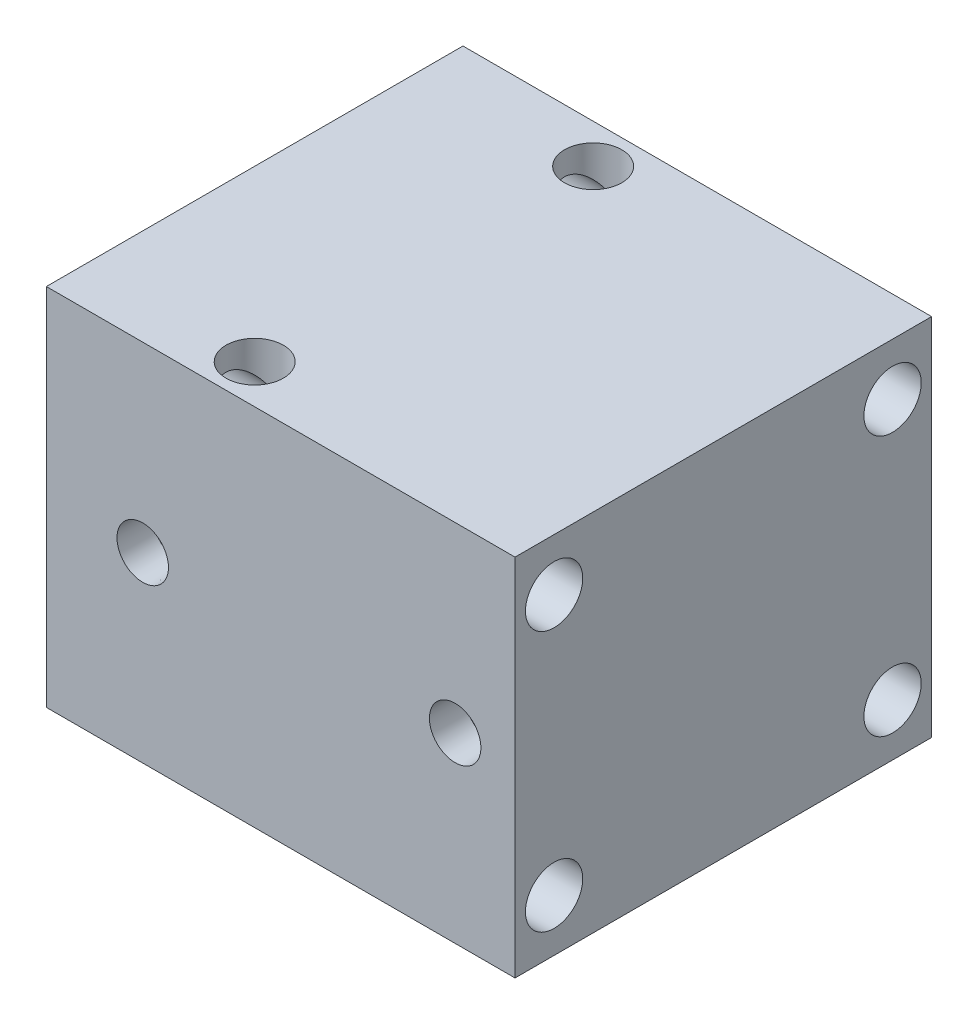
ISO-10303-21;
HEADER;
FILE_DESCRIPTION(('STEP AP214'),'2;1');
FILE_NAME('part.step','',(''),(''),'','','');
FILE_SCHEMA(('AUTOMOTIVE_DESIGN { 1 0 10303 214 1 1 1 1 }'));
ENDSEC;
DATA;
#1=APPLICATION_CONTEXT('core data for automotive mechanical design processes');
#2=APPLICATION_PROTOCOL_DEFINITION('international standard','automotive_design',2000,#1);
#3=PRODUCT_CONTEXT('',#1,'mechanical');
#4=PRODUCT('Part','Part','',(#3));
#5=PRODUCT_RELATED_PRODUCT_CATEGORY('part','',(#4));
#6=PRODUCT_DEFINITION_FORMATION('','',#4);
#7=PRODUCT_DEFINITION_CONTEXT('part definition',#1,'design');
#8=PRODUCT_DEFINITION('design','',#6,#7);
#9=PRODUCT_DEFINITION_SHAPE('','',#8);
#10=(LENGTH_UNIT() NAMED_UNIT(*) SI_UNIT(.MILLI.,.METRE.));
#11=(NAMED_UNIT(*) PLANE_ANGLE_UNIT() SI_UNIT($,.RADIAN.));
#12=(NAMED_UNIT(*) SI_UNIT($,.STERADIAN.) SOLID_ANGLE_UNIT());
#13=UNCERTAINTY_MEASURE_WITH_UNIT(LENGTH_MEASURE(1.E-05),#10,'distance_accuracy_value','');
#14=(GEOMETRIC_REPRESENTATION_CONTEXT(3) GLOBAL_UNCERTAINTY_ASSIGNED_CONTEXT((#13)) GLOBAL_UNIT_ASSIGNED_CONTEXT((#10,
#11,#12)) REPRESENTATION_CONTEXT('',''));
#15=CARTESIAN_POINT('',(0.,0.,0.));
#16=DIRECTION('',(0.,0.,1.));
#17=DIRECTION('',(1.,0.,0.));
#18=AXIS2_PLACEMENT_3D('',#15,#16,#17);
#19=CARTESIAN_POINT('',(-25.,140.,65.));
#20=DIRECTION('',(0.,-1.,0.));
#21=DIRECTION('',(0.,0.,-1.));
#22=AXIS2_PLACEMENT_3D('',#19,#20,#21);
#23=CYLINDRICAL_SURFACE('',#22,11.);
#24=CARTESIAN_POINT('',(-25.,20.,65.));
#25=DIRECTION('',(-0.707106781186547,-0.707106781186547,0.));
#26=DIRECTION('',(0.707106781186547,-0.707106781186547,0.));
#27=AXIS2_PLACEMENT_3D('',#24,#25,#26);
#28=ELLIPSE('',#27,15.556349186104,11.);
#29=CARTESIAN_POINT('',(-25.,20.,54.));
#30=VERTEX_POINT('',#29);
#31=CARTESIAN_POINT('',(-25.,20.,76.));
#32=VERTEX_POINT('',#31);
#33=EDGE_CURVE('E11',#30,#32,#28,.F.);
#34=ORIENTED_EDGE('',*,*,#33,.F.);
#35=CARTESIAN_POINT('',(-25.,20.,65.));
#36=DIRECTION('',(0.707106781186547,-0.707106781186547,0.));
#37=DIRECTION('',(-0.707106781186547,-0.707106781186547,0.));
#38=AXIS2_PLACEMENT_3D('',#35,#36,#37);
#39=ELLIPSE('',#38,15.556349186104,11.);
#40=EDGE_CURVE('E51',#32,#30,#39,.F.);
#41=ORIENTED_EDGE('',*,*,#40,.F.);
#42=EDGE_LOOP('',(#34,#41));
#43=FACE_BOUND('',#42,.T.);
#44=CARTESIAN_POINT('',(-25.,120.,65.));
#45=DIRECTION('',(-0.707106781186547,-0.707106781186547,0.));
#46=DIRECTION('',(0.707106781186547,-0.707106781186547,0.));
#47=AXIS2_PLACEMENT_3D('',#44,#45,#46);
#48=ELLIPSE('',#47,15.556349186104,11.);
#49=CARTESIAN_POINT('',(-25.,120.,54.));
#50=VERTEX_POINT('',#49);
#51=CARTESIAN_POINT('',(-25.,120.,76.));
#52=VERTEX_POINT('',#51);
#53=EDGE_CURVE('E252',#50,#52,#48,.T.);
#54=ORIENTED_EDGE('',*,*,#53,.F.);
#55=CARTESIAN_POINT('',(-25.,120.,65.));
#56=DIRECTION('',(0.707106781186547,-0.707106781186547,0.));
#57=DIRECTION('',(-0.707106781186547,-0.707106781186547,0.));
#58=AXIS2_PLACEMENT_3D('',#55,#56,#57);
#59=ELLIPSE('',#58,15.556349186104,11.);
#60=EDGE_CURVE('E250',#52,#50,#59,.T.);
#61=ORIENTED_EDGE('',*,*,#60,.F.);
#62=EDGE_LOOP('',(#54,#61));
#63=FACE_BOUND('',#62,.T.);
#64=ADVANCED_FACE('F35',(#43,#63),#23,.F.);
#65=CARTESIAN_POINT('',(-25.,120.,65.));
#66=DIRECTION('',(-0.707106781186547,-0.707106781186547,0.));
#67=DIRECTION('',(0.707106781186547,-0.707106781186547,0.));
#68=AXIS2_PLACEMENT_3D('',#65,#66,#67);
#69=ELLIPSE('',#68,15.556349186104,11.);
#70=EDGE_CURVE('E112',#50,#52,#69,.F.);
#71=ORIENTED_EDGE('',*,*,#70,.F.);
#72=CARTESIAN_POINT('',(-25.,120.,65.));
#73=DIRECTION('',(0.707106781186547,-0.707106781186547,0.));
#74=DIRECTION('',(-0.707106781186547,-0.707106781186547,0.));
#75=AXIS2_PLACEMENT_3D('',#72,#73,#74);
#76=ELLIPSE('',#75,15.556349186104,11.);
#77=EDGE_CURVE('E58',#52,#50,#76,.F.);
#78=ORIENTED_EDGE('',*,*,#77,.F.);
#79=EDGE_LOOP('',(#71,#78));
#80=FACE_BOUND('',#79,.T.);
#81=CARTESIAN_POINT('',(-25.,140.,65.));
#82=DIRECTION('',(0.,1.,0.));
#83=DIRECTION('',(0.,0.,1.));
#84=AXIS2_PLACEMENT_3D('',#81,#82,#83);
#85=CIRCLE('',#84,11.);
#86=CARTESIAN_POINT('',(-25.,140.,76.));
#87=VERTEX_POINT('',#86);
#88=EDGE_CURVE('E186',#87,#87,#85,.T.);
#89=ORIENTED_EDGE('',*,*,#88,.T.);
#90=EDGE_LOOP('',(#89));
#91=FACE_BOUND('',#90,.T.);
#92=ADVANCED_FACE('F307',(#80,#91),#23,.F.);
#93=CARTESIAN_POINT('',(-25.,140.,-65.));
#94=DIRECTION('',(0.,-1.,0.));
#95=DIRECTION('',(0.,0.,-1.));
#96=AXIS2_PLACEMENT_3D('',#93,#94,#95);
#97=CYLINDRICAL_SURFACE('',#96,11.);
#98=CARTESIAN_POINT('',(-25.,20.,-65.));
#99=DIRECTION('',(-0.707106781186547,-0.707106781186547,0.));
#100=DIRECTION('',(0.707106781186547,-0.707106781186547,0.));
#101=AXIS2_PLACEMENT_3D('',#98,#99,#100);
#102=ELLIPSE('',#101,15.556349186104,11.);
#103=CARTESIAN_POINT('',(-25.,20.,-76.));
#104=VERTEX_POINT('',#103);
#105=CARTESIAN_POINT('',(-25.,20.,-54.));
#106=VERTEX_POINT('',#105);
#107=EDGE_CURVE('E246',#104,#106,#102,.F.);
#108=ORIENTED_EDGE('',*,*,#107,.F.);
#109=CARTESIAN_POINT('',(-25.,20.,-65.));
#110=DIRECTION('',(0.707106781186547,-0.707106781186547,0.));
#111=DIRECTION('',(-0.707106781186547,-0.707106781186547,0.));
#112=AXIS2_PLACEMENT_3D('',#109,#110,#111);
#113=ELLIPSE('',#112,15.556349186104,11.);
#114=EDGE_CURVE('E238',#106,#104,#113,.F.);
#115=ORIENTED_EDGE('',*,*,#114,.F.);
#116=EDGE_LOOP('',(#108,#115));
#117=FACE_BOUND('',#116,.T.);
#118=CARTESIAN_POINT('',(-25.,120.,-65.));
#119=DIRECTION('',(-0.707106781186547,-0.707106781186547,0.));
#120=DIRECTION('',(0.707106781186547,-0.707106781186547,0.));
#121=AXIS2_PLACEMENT_3D('',#118,#119,#120);
#122=ELLIPSE('',#121,15.556349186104,11.);
#123=CARTESIAN_POINT('',(-25.,120.,-76.));
#124=VERTEX_POINT('',#123);
#125=CARTESIAN_POINT('',(-25.,120.,-54.));
#126=VERTEX_POINT('',#125);
#127=EDGE_CURVE('E232',#124,#126,#122,.T.);
#128=ORIENTED_EDGE('',*,*,#127,.F.);
#129=CARTESIAN_POINT('',(-25.,120.,-65.));
#130=DIRECTION('',(0.707106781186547,-0.707106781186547,0.));
#131=DIRECTION('',(-0.707106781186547,-0.707106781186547,0.));
#132=AXIS2_PLACEMENT_3D('',#129,#130,#131);
#133=ELLIPSE('',#132,15.556349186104,11.);
#134=EDGE_CURVE('E230',#126,#124,#133,.T.);
#135=ORIENTED_EDGE('',*,*,#134,.F.);
#136=EDGE_LOOP('',(#128,#135));
#137=FACE_BOUND('',#136,.T.);
#138=ADVANCED_FACE('F312',(#117,#137),#97,.F.);
#139=CARTESIAN_POINT('',(-25.,120.,-65.));
#140=DIRECTION('',(-0.707106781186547,-0.707106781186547,0.));
#141=DIRECTION('',(0.707106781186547,-0.707106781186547,0.));
#142=AXIS2_PLACEMENT_3D('',#139,#140,#141);
#143=ELLIPSE('',#142,15.556349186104,11.);
#144=EDGE_CURVE('E235',#124,#126,#143,.F.);
#145=ORIENTED_EDGE('',*,*,#144,.F.);
#146=CARTESIAN_POINT('',(-25.,120.,-65.));
#147=DIRECTION('',(0.707106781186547,-0.707106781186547,0.));
#148=DIRECTION('',(-0.707106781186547,-0.707106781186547,0.));
#149=AXIS2_PLACEMENT_3D('',#146,#147,#148);
#150=ELLIPSE('',#149,15.556349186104,11.);
#151=EDGE_CURVE('E227',#126,#124,#150,.F.);
#152=ORIENTED_EDGE('',*,*,#151,.F.);
#153=EDGE_LOOP('',(#145,#152));
#154=FACE_BOUND('',#153,.T.);
#155=CARTESIAN_POINT('',(-25.,140.,-65.));
#156=DIRECTION('',(0.,1.,0.));
#157=DIRECTION('',(0.,0.,1.));
#158=AXIS2_PLACEMENT_3D('',#155,#156,#157);
#159=CIRCLE('',#158,11.);
#160=CARTESIAN_POINT('',(-25.,140.,-54.));
#161=VERTEX_POINT('',#160);
#162=EDGE_CURVE('E192',#161,#161,#159,.T.);
#163=ORIENTED_EDGE('',*,*,#162,.T.);
#164=EDGE_LOOP('',(#163));
#165=FACE_BOUND('',#164,.T.);
#166=ADVANCED_FACE('F325',(#154,#165),#97,.F.);
#167=CARTESIAN_POINT('',(-90.,140.,80.));
#168=DIRECTION('',(0.,1.,0.));
#169=DIRECTION('',(0.,0.,1.));
#170=AXIS2_PLACEMENT_3D('',#167,#168,#169);
#171=PLANE('',#170);
#172=ORIENTED_EDGE('',*,*,#162,.F.);
#173=EDGE_LOOP('',(#172));
#174=FACE_BOUND('',#173,.T.);
#175=DIRECTION('',(0.,0.,1.));
#176=VECTOR('',#175,1.);
#177=CARTESIAN_POINT('',(-90.,140.,-80.));
#178=LINE('',#177,#176);
#179=CARTESIAN_POINT('',(-90.,140.,-80.));
#180=VERTEX_POINT('',#179);
#181=CARTESIAN_POINT('',(-90.,140.,80.));
#182=VERTEX_POINT('',#181);
#183=EDGE_CURVE('E198',#180,#182,#178,.T.);
#184=ORIENTED_EDGE('',*,*,#183,.T.);
#185=DIRECTION('',(1.,0.,0.));
#186=VECTOR('',#185,1.);
#187=CARTESIAN_POINT('',(-90.,140.,80.));
#188=LINE('',#187,#186);
#189=CARTESIAN_POINT('',(90.,140.,80.));
#190=VERTEX_POINT('',#189);
#191=EDGE_CURVE('E201',#182,#190,#188,.T.);
#192=ORIENTED_EDGE('',*,*,#191,.T.);
#193=DIRECTION('',(0.,0.,-1.));
#194=VECTOR('',#193,1.);
#195=CARTESIAN_POINT('',(90.,140.,-80.));
#196=LINE('',#195,#194);
#197=CARTESIAN_POINT('',(90.,140.,-80.));
#198=VERTEX_POINT('',#197);
#199=EDGE_CURVE('E204',#190,#198,#196,.T.);
#200=ORIENTED_EDGE('',*,*,#199,.T.);
#201=DIRECTION('',(-1.,0.,0.));
#202=VECTOR('',#201,1.);
#203=CARTESIAN_POINT('',(-90.,140.,-80.));
#204=LINE('',#203,#202);
#205=EDGE_CURVE('E206',#198,#180,#204,.T.);
#206=ORIENTED_EDGE('',*,*,#205,.T.);
#207=EDGE_LOOP('',(#184,#192,#200,#206));
#208=FACE_BOUND('',#207,.T.);
#209=ORIENTED_EDGE('',*,*,#88,.F.);
#210=EDGE_LOOP('',(#209));
#211=FACE_BOUND('',#210,.T.);
#212=ADVANCED_FACE('F295',(#174,#208,#211),#171,.T.);
#213=CARTESIAN_POINT('',(-90.,0.,80.));
#214=DIRECTION('',(0.,1.,0.));
#215=DIRECTION('',(0.,0.,1.));
#216=AXIS2_PLACEMENT_3D('',#213,#214,#215);
#217=PLANE('',#216);
#218=CARTESIAN_POINT('',(-25.,0.,-65.));
#219=DIRECTION('',(0.,1.,0.));
#220=DIRECTION('',(0.,0.,1.));
#221=AXIS2_PLACEMENT_3D('',#218,#219,#220);
#222=CIRCLE('',#221,11.);
#223=CARTESIAN_POINT('',(-25.,0.,-54.));
#224=VERTEX_POINT('',#223);
#225=EDGE_CURVE('E189',#224,#224,#222,.T.);
#226=ORIENTED_EDGE('',*,*,#225,.T.);
#227=EDGE_LOOP('',(#226));
#228=FACE_BOUND('',#227,.T.);
#229=DIRECTION('',(0.,0.,1.));
#230=VECTOR('',#229,1.);
#231=CARTESIAN_POINT('',(-90.,0.,-80.));
#232=LINE('',#231,#230);
#233=CARTESIAN_POINT('',(-90.,0.,-80.));
#234=VERTEX_POINT('',#233);
#235=CARTESIAN_POINT('',(-90.,0.,80.));
#236=VERTEX_POINT('',#235);
#237=EDGE_CURVE('E195',#234,#236,#232,.T.);
#238=ORIENTED_EDGE('',*,*,#237,.F.);
#239=DIRECTION('',(-1.,0.,0.));
#240=VECTOR('',#239,1.);
#241=CARTESIAN_POINT('',(-90.,0.,-80.));
#242=LINE('',#241,#240);
#243=CARTESIAN_POINT('',(90.,0.,-80.));
#244=VERTEX_POINT('',#243);
#245=EDGE_CURVE('E202',#244,#234,#242,.T.);
#246=ORIENTED_EDGE('',*,*,#245,.F.);
#247=DIRECTION('',(0.,0.,-1.));
#248=VECTOR('',#247,1.);
#249=CARTESIAN_POINT('',(90.,0.,-80.));
#250=LINE('',#249,#248);
#251=CARTESIAN_POINT('',(90.,0.,80.));
#252=VERTEX_POINT('',#251);
#253=EDGE_CURVE('E213',#252,#244,#250,.T.);
#254=ORIENTED_EDGE('',*,*,#253,.F.);
#255=DIRECTION('',(1.,0.,0.));
#256=VECTOR('',#255,1.);
#257=CARTESIAN_POINT('',(-90.,0.,80.));
#258=LINE('',#257,#256);
#259=EDGE_CURVE('E211',#236,#252,#258,.T.);
#260=ORIENTED_EDGE('',*,*,#259,.F.);
#261=EDGE_LOOP('',(#238,#246,#254,#260));
#262=FACE_BOUND('',#261,.T.);
#263=CARTESIAN_POINT('',(-25.,0.,65.));
#264=DIRECTION('',(0.,1.,0.));
#265=DIRECTION('',(0.,0.,1.));
#266=AXIS2_PLACEMENT_3D('',#263,#264,#265);
#267=CIRCLE('',#266,11.);
#268=CARTESIAN_POINT('',(-25.,0.,76.));
#269=VERTEX_POINT('',#268);
#270=EDGE_CURVE('E183',#269,#269,#267,.T.);
#271=ORIENTED_EDGE('',*,*,#270,.T.);
#272=EDGE_LOOP('',(#271));
#273=FACE_BOUND('',#272,.T.);
#274=ADVANCED_FACE('F289',(#228,#262,#273),#217,.F.);
#275=CARTESIAN_POINT('',(-90.,140.,-80.));
#276=DIRECTION('',(1.,0.,0.));
#277=DIRECTION('',(0.,0.,-1.));
#278=AXIS2_PLACEMENT_3D('',#275,#276,#277);
#279=PLANE('',#278);
#280=CARTESIAN_POINT('',(-90.,20.,65.));
#281=DIRECTION('',(-1.,0.,0.));
#282=DIRECTION('',(0.,0.,1.));
#283=AXIS2_PLACEMENT_3D('',#280,#281,#282);
#284=CIRCLE('',#283,11.);
#285=CARTESIAN_POINT('',(-90.,20.,76.));
#286=VERTEX_POINT('',#285);
#287=EDGE_CURVE('E120',#286,#286,#284,.T.);
#288=ORIENTED_EDGE('',*,*,#287,.F.);
#289=EDGE_LOOP('',(#288));
#290=FACE_BOUND('',#289,.T.);
#291=CARTESIAN_POINT('',(-90.,120.,65.));
#292=DIRECTION('',(-1.,0.,0.));
#293=DIRECTION('',(0.,0.,1.));
#294=AXIS2_PLACEMENT_3D('',#291,#292,#293);
#295=CIRCLE('',#294,11.);
#296=CARTESIAN_POINT('',(-90.,120.,76.));
#297=VERTEX_POINT('',#296);
#298=EDGE_CURVE('E137',#297,#297,#295,.T.);
#299=ORIENTED_EDGE('',*,*,#298,.F.);
#300=EDGE_LOOP('',(#299));
#301=FACE_BOUND('',#300,.T.);
#302=CARTESIAN_POINT('',(-90.,20.,-65.));
#303=DIRECTION('',(-1.,0.,0.));
#304=DIRECTION('',(0.,0.,1.));
#305=AXIS2_PLACEMENT_3D('',#302,#303,#304);
#306=CIRCLE('',#305,11.);
#307=CARTESIAN_POINT('',(-90.,20.,-54.));
#308=VERTEX_POINT('',#307);
#309=EDGE_CURVE('E143',#308,#308,#306,.T.);
#310=ORIENTED_EDGE('',*,*,#309,.F.);
#311=EDGE_LOOP('',(#310));
#312=FACE_BOUND('',#311,.T.);
#313=CARTESIAN_POINT('',(-90.,120.,-65.));
#314=DIRECTION('',(-1.,0.,0.));
#315=DIRECTION('',(0.,0.,1.));
#316=AXIS2_PLACEMENT_3D('',#313,#314,#315);
#317=CIRCLE('',#316,11.);
#318=CARTESIAN_POINT('',(-90.,120.,-54.));
#319=VERTEX_POINT('',#318);
#320=EDGE_CURVE('E149',#319,#319,#317,.T.);
#321=ORIENTED_EDGE('',*,*,#320,.F.);
#322=EDGE_LOOP('',(#321));
#323=FACE_BOUND('',#322,.T.);
#324=CARTESIAN_POINT('',(-90.,70.,0.));
#325=DIRECTION('',(-1.,0.,0.));
#326=DIRECTION('',(0.,0.,1.));
#327=AXIS2_PLACEMENT_3D('',#324,#325,#326);
#328=CIRCLE('',#327,1.5);
#329=CARTESIAN_POINT('',(-90.,70.,1.5));
#330=VERTEX_POINT('',#329);
#331=EDGE_CURVE('E179',#330,#330,#328,.T.);
#332=ORIENTED_EDGE('',*,*,#331,.F.);
#333=EDGE_LOOP('',(#332));
#334=FACE_BOUND('',#333,.T.);
#335=ORIENTED_EDGE('',*,*,#237,.T.);
#336=DIRECTION('',(0.,-1.,0.));
#337=VECTOR('',#336,1.);
#338=CARTESIAN_POINT('',(-90.,140.,80.));
#339=LINE('',#338,#337);
#340=EDGE_CURVE('E224',#182,#236,#339,.T.);
#341=ORIENTED_EDGE('',*,*,#340,.F.);
#342=ORIENTED_EDGE('',*,*,#183,.F.);
#343=DIRECTION('',(0.,-1.,0.));
#344=VECTOR('',#343,1.);
#345=CARTESIAN_POINT('',(-90.,140.,-80.));
#346=LINE('',#345,#344);
#347=EDGE_CURVE('E208',#180,#234,#346,.T.);
#348=ORIENTED_EDGE('',*,*,#347,.T.);
#349=EDGE_LOOP('',(#335,#341,#342,#348));
#350=FACE_BOUND('',#349,.T.);
#351=ADVANCED_FACE('F37',(#290,#301,#312,#323,#334,#350),#279,.F.);
#352=CARTESIAN_POINT('',(-90.,140.,80.));
#353=DIRECTION('',(0.,0.,-1.));
#354=DIRECTION('',(-1.,0.,0.));
#355=AXIS2_PLACEMENT_3D('',#352,#353,#354);
#356=PLANE('',#355);
#357=CARTESIAN_POINT('',(67.,70.,80.));
#358=DIRECTION('',(0.,0.,1.));
#359=DIRECTION('',(1.,0.,0.));
#360=AXIS2_PLACEMENT_3D('',#357,#358,#359);
#361=CIRCLE('',#360,9.8860229);
#362=CARTESIAN_POINT('',(76.8860229,70.,80.));
#363=VERTEX_POINT('',#362);
#364=EDGE_CURVE('E155',#363,#363,#361,.T.);
#365=ORIENTED_EDGE('',*,*,#364,.F.);
#366=EDGE_LOOP('',(#365));
#367=FACE_BOUND('',#366,.T.);
#368=CARTESIAN_POINT('',(-53.,70.,80.));
#369=DIRECTION('',(0.,0.,1.));
#370=DIRECTION('',(1.,0.,0.));
#371=AXIS2_PLACEMENT_3D('',#368,#369,#370);
#372=CIRCLE('',#371,9.8860229);
#373=CARTESIAN_POINT('',(-43.1139771,70.,80.));
#374=VERTEX_POINT('',#373);
#375=EDGE_CURVE('E167',#374,#374,#372,.T.);
#376=ORIENTED_EDGE('',*,*,#375,.F.);
#377=EDGE_LOOP('',(#376));
#378=FACE_BOUND('',#377,.T.);
#379=ORIENTED_EDGE('',*,*,#259,.T.);
#380=DIRECTION('',(0.,-1.,0.));
#381=VECTOR('',#380,1.);
#382=CARTESIAN_POINT('',(90.,140.,80.));
#383=LINE('',#382,#381);
#384=EDGE_CURVE('E221',#190,#252,#383,.T.);
#385=ORIENTED_EDGE('',*,*,#384,.F.);
#386=ORIENTED_EDGE('',*,*,#191,.F.);
#387=ORIENTED_EDGE('',*,*,#340,.T.);
#388=EDGE_LOOP('',(#379,#385,#386,#387));
#389=FACE_BOUND('',#388,.T.);
#390=ADVANCED_FACE('F272',(#367,#378,#389),#356,.F.);
#391=CARTESIAN_POINT('',(90.,140.,-80.));
#392=DIRECTION('',(-1.,0.,0.));
#393=DIRECTION('',(0.,0.,1.));
#394=AXIS2_PLACEMENT_3D('',#391,#392,#393);
#395=PLANE('',#394);
#396=CARTESIAN_POINT('',(90.,20.,65.));
#397=DIRECTION('',(-1.,0.,0.));
#398=DIRECTION('',(0.,0.,1.));
#399=AXIS2_PLACEMENT_3D('',#396,#397,#398);
#400=CIRCLE('',#399,11.);
#401=CARTESIAN_POINT('',(90.,20.,76.));
#402=VERTEX_POINT('',#401);
#403=EDGE_CURVE('E125',#402,#402,#400,.F.);
#404=ORIENTED_EDGE('',*,*,#403,.F.);
#405=EDGE_LOOP('',(#404));
#406=FACE_BOUND('',#405,.T.);
#407=CARTESIAN_POINT('',(90.,120.,65.));
#408=DIRECTION('',(-1.,0.,0.));
#409=DIRECTION('',(0.,0.,1.));
#410=AXIS2_PLACEMENT_3D('',#407,#408,#409);
#411=CIRCLE('',#410,11.);
#412=CARTESIAN_POINT('',(90.,120.,76.));
#413=VERTEX_POINT('',#412);
#414=EDGE_CURVE('E140',#413,#413,#411,.F.);
#415=ORIENTED_EDGE('',*,*,#414,.F.);
#416=EDGE_LOOP('',(#415));
#417=FACE_BOUND('',#416,.T.);
#418=CARTESIAN_POINT('',(90.,20.,-65.));
#419=DIRECTION('',(-1.,0.,0.));
#420=DIRECTION('',(0.,0.,1.));
#421=AXIS2_PLACEMENT_3D('',#418,#419,#420);
#422=CIRCLE('',#421,11.);
#423=CARTESIAN_POINT('',(90.,20.,-54.));
#424=VERTEX_POINT('',#423);
#425=EDGE_CURVE('E146',#424,#424,#422,.F.);
#426=ORIENTED_EDGE('',*,*,#425,.F.);
#427=EDGE_LOOP('',(#426));
#428=FACE_BOUND('',#427,.T.);
#429=CARTESIAN_POINT('',(90.,120.,-65.));
#430=DIRECTION('',(-1.,0.,0.));
#431=DIRECTION('',(0.,0.,1.));
#432=AXIS2_PLACEMENT_3D('',#429,#430,#431);
#433=CIRCLE('',#432,11.);
#434=CARTESIAN_POINT('',(90.,120.,-54.));
#435=VERTEX_POINT('',#434);
#436=EDGE_CURVE('E152',#435,#435,#433,.F.);
#437=ORIENTED_EDGE('',*,*,#436,.F.);
#438=EDGE_LOOP('',(#437));
#439=FACE_BOUND('',#438,.T.);
#440=ORIENTED_EDGE('',*,*,#253,.T.);
#441=DIRECTION('',(0.,-1.,0.));
#442=VECTOR('',#441,1.);
#443=CARTESIAN_POINT('',(90.,140.,-80.));
#444=LINE('',#443,#442);
#445=EDGE_CURVE('E218',#198,#244,#444,.T.);
#446=ORIENTED_EDGE('',*,*,#445,.F.);
#447=ORIENTED_EDGE('',*,*,#199,.F.);
#448=ORIENTED_EDGE('',*,*,#384,.T.);
#449=EDGE_LOOP('',(#440,#446,#447,#448));
#450=FACE_BOUND('',#449,.T.);
#451=ADVANCED_FACE('F268',(#406,#417,#428,#439,#450),#395,.F.);
#452=CARTESIAN_POINT('',(-90.,140.,-80.));
#453=DIRECTION('',(0.,0.,1.));
#454=DIRECTION('',(1.,0.,0.));
#455=AXIS2_PLACEMENT_3D('',#452,#453,#454);
#456=PLANE('',#455);
#457=ORIENTED_EDGE('',*,*,#245,.T.);
#458=ORIENTED_EDGE('',*,*,#347,.F.);
#459=ORIENTED_EDGE('',*,*,#205,.F.);
#460=ORIENTED_EDGE('',*,*,#445,.T.);
#461=EDGE_LOOP('',(#457,#458,#459,#460));
#462=FACE_BOUND('',#461,.T.);
#463=ADVANCED_FACE('F271',(#462),#456,.F.);
#464=CARTESIAN_POINT('',(-25.,20.,-65.));
#465=DIRECTION('',(-0.707106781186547,-0.707106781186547,0.));
#466=DIRECTION('',(0.707106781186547,-0.707106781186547,0.));
#467=AXIS2_PLACEMENT_3D('',#464,#465,#466);
#468=ELLIPSE('',#467,15.556349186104,11.);
#469=EDGE_CURVE('E243',#104,#106,#468,.T.);
#470=ORIENTED_EDGE('',*,*,#469,.F.);
#471=CARTESIAN_POINT('',(-25.,20.,-65.));
#472=DIRECTION('',(0.707106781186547,-0.707106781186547,0.));
#473=DIRECTION('',(-0.707106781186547,-0.707106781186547,0.));
#474=AXIS2_PLACEMENT_3D('',#471,#472,#473);
#475=ELLIPSE('',#474,15.556349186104,11.);
#476=EDGE_CURVE('E241',#106,#104,#475,.T.);
#477=ORIENTED_EDGE('',*,*,#476,.F.);
#478=EDGE_LOOP('',(#470,#477));
#479=FACE_BOUND('',#478,.T.);
#480=ORIENTED_EDGE('',*,*,#225,.F.);
#481=EDGE_LOOP('',(#480));
#482=FACE_BOUND('',#481,.T.);
#483=ADVANCED_FACE('F317',(#479,#482),#97,.F.);
#484=CARTESIAN_POINT('',(-25.,20.,65.));
#485=DIRECTION('',(-0.707106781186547,-0.707106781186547,0.));
#486=DIRECTION('',(0.707106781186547,-0.707106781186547,0.));
#487=AXIS2_PLACEMENT_3D('',#484,#485,#486);
#488=ELLIPSE('',#487,15.556349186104,11.);
#489=EDGE_CURVE('E44',#30,#32,#488,.T.);
#490=ORIENTED_EDGE('',*,*,#489,.F.);
#491=CARTESIAN_POINT('',(-25.,20.,65.));
#492=DIRECTION('',(0.707106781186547,-0.707106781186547,0.));
#493=DIRECTION('',(-0.707106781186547,-0.707106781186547,0.));
#494=AXIS2_PLACEMENT_3D('',#491,#492,#493);
#495=ELLIPSE('',#494,15.556349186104,11.);
#496=EDGE_CURVE('E103',#32,#30,#495,.T.);
#497=ORIENTED_EDGE('',*,*,#496,.F.);
#498=EDGE_LOOP('',(#490,#497));
#499=FACE_BOUND('',#498,.T.);
#500=ORIENTED_EDGE('',*,*,#270,.F.);
#501=EDGE_LOOP('',(#500));
#502=FACE_BOUND('',#501,.T.);
#503=ADVANCED_FACE('F115',(#499,#502),#23,.F.);
#504=CARTESIAN_POINT('',(-30.,70.,0.));
#505=DIRECTION('',(-1.,0.,0.));
#506=DIRECTION('',(0.,0.,1.));
#507=AXIS2_PLACEMENT_3D('',#504,#505,#506);
#508=CYLINDRICAL_SURFACE('',#507,1.5);
#509=CARTESIAN_POINT('',(-30.,70.,0.));
#510=DIRECTION('',(-1.,0.,0.));
#511=DIRECTION('',(0.,0.,1.));
#512=AXIS2_PLACEMENT_3D('',#509,#510,#511);
#513=CIRCLE('',#512,1.5);
#514=CARTESIAN_POINT('',(-30.,70.,1.49999999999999));
#515=VERTEX_POINT('',#514);
#516=EDGE_CURVE('E180',#515,#515,#513,.T.);
#517=ORIENTED_EDGE('',*,*,#516,.F.);
#518=EDGE_LOOP('',(#517));
#519=FACE_BOUND('',#518,.T.);
#520=ORIENTED_EDGE('',*,*,#331,.T.);
#521=EDGE_LOOP('',(#520));
#522=FACE_BOUND('',#521,.T.);
#523=ADVANCED_FACE('F316',(#519,#522),#508,.F.);
#524=CARTESIAN_POINT('',(-30.,70.,0.));
#525=DIRECTION('',(-1.,0.,0.));
#526=DIRECTION('',(0.,0.,1.));
#527=AXIS2_PLACEMENT_3D('',#524,#525,#526);
#528=PLANE('',#527);
#529=ORIENTED_EDGE('',*,*,#516,.T.);
#530=EDGE_LOOP('',(#529));
#531=FACE_BOUND('',#530,.T.);
#532=ADVANCED_FACE('F322',(#531),#528,.T.);
#533=CARTESIAN_POINT('',(-53.,70.,57.36));
#534=DIRECTION('',(0.,0.,1.));
#535=DIRECTION('',(1.,0.,0.));
#536=AXIS2_PLACEMENT_3D('',#533,#534,#535);
#537=CONICAL_SURFACE('',#536,8.92809999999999,1.02974425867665);
#538=CARTESIAN_POINT('',(-53.,70.,53.1971775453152));
#539=DIRECTION('',(0.,0.,1.));
#540=DIRECTION('',(1.,0.,0.));
#541=AXIS2_PLACEMENT_3D('',#538,#539,#540);
#542=CIRCLE('',#541,2.00000000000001);
#543=CARTESIAN_POINT('',(-51.,70.,53.1971775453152));
#544=VERTEX_POINT('',#543);
#545=EDGE_CURVE('E118',#544,#544,#542,.F.);
#546=CARTESIAN_POINT('',(-53.,70.,57.36));
#547=DIRECTION('',(0.,0.,1.));
#548=DIRECTION('',(1.,0.,0.));
#549=AXIS2_PLACEMENT_3D('',#546,#547,#548);
#550=CIRCLE('',#549,8.92809999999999);
#551=CARTESIAN_POINT('',(-44.0719,70.,57.36));
#552=VERTEX_POINT('',#551);
#553=EDGE_CURVE('E176',#552,#552,#550,.T.);
#554=CARTESIAN_POINT('',(-51.,70.,53.1971775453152));
#555=CARTESIAN_POINT('',(-50.9278322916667,70.,53.2405402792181));
#556=CARTESIAN_POINT('',(-50.8556645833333,70.,53.2839030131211));
#557=CARTESIAN_POINT('',(-50.7113291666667,70.,53.370628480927));
#558=CARTESIAN_POINT('',(-50.6391614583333,70.,53.41399121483));
#559=CARTESIAN_POINT('',(-50.4948260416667,70.,53.5007166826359));
#560=CARTESIAN_POINT('',(-50.4226583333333,70.,53.5440794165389));
#561=CARTESIAN_POINT('',(-50.2783229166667,70.,53.6308048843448));
#562=CARTESIAN_POINT('',(-50.2061552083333,70.,53.6741676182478));
#563=CARTESIAN_POINT('',(-50.0618197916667,70.,53.7608930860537));
#564=CARTESIAN_POINT('',(-49.9896520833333,70.,53.8042558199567));
#565=CARTESIAN_POINT('',(-49.8453166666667,70.,53.8909812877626));
#566=CARTESIAN_POINT('',(-49.7731489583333,70.,53.9343440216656));
#567=CARTESIAN_POINT('',(-49.6288135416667,70.,54.0210694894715));
#568=CARTESIAN_POINT('',(-49.5566458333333,70.,54.0644322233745));
#569=CARTESIAN_POINT('',(-49.4123104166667,70.,54.1511576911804));
#570=CARTESIAN_POINT('',(-49.3401427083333,70.,54.1945204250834));
#571=CARTESIAN_POINT('',(-49.1958072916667,70.,54.2812458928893));
#572=CARTESIAN_POINT('',(-49.1236395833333,70.,54.3246086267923));
#573=CARTESIAN_POINT('',(-48.9793041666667,70.,54.4113340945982));
#574=CARTESIAN_POINT('',(-48.9071364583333,70.,54.4546968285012));
#575=CARTESIAN_POINT('',(-48.7628010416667,70.,54.5414222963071));
#576=CARTESIAN_POINT('',(-48.6906333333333,70.,54.5847850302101));
#577=CARTESIAN_POINT('',(-48.5462979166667,70.,54.671510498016));
#578=CARTESIAN_POINT('',(-48.4741302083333,70.,54.714873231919));
#579=CARTESIAN_POINT('',(-48.3297947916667,70.,54.8015986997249));
#580=CARTESIAN_POINT('',(-48.2576270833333,70.,54.8449614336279));
#581=CARTESIAN_POINT('',(-48.1132916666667,70.,54.9316869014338));
#582=CARTESIAN_POINT('',(-48.0411239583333,70.,54.9750496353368));
#583=CARTESIAN_POINT('',(-47.8967885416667,70.,55.0617751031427));
#584=CARTESIAN_POINT('',(-47.8246208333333,70.,55.1051378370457));
#585=CARTESIAN_POINT('',(-47.6802854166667,70.,55.1918633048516));
#586=CARTESIAN_POINT('',(-47.6081177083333,70.,55.2352260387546));
#587=CARTESIAN_POINT('',(-47.4637822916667,70.,55.3219515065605));
#588=CARTESIAN_POINT('',(-47.3916145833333,70.,55.3653142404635));
#589=CARTESIAN_POINT('',(-47.2472791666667,70.,55.4520397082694));
#590=CARTESIAN_POINT('',(-47.1751114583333,70.,55.4954024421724));
#591=CARTESIAN_POINT('',(-47.0307760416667,70.,55.5821279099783));
#592=CARTESIAN_POINT('',(-46.9586083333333,70.,55.6254906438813));
#593=CARTESIAN_POINT('',(-46.8142729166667,70.,55.7122161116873));
#594=CARTESIAN_POINT('',(-46.7421052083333,70.,55.7555788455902));
#595=CARTESIAN_POINT('',(-46.5977697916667,70.,55.8423043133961));
#596=CARTESIAN_POINT('',(-46.5256020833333,70.,55.8856670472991));
#597=CARTESIAN_POINT('',(-46.3812666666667,70.,55.972392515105));
#598=CARTESIAN_POINT('',(-46.3090989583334,70.,56.015755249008));
#599=CARTESIAN_POINT('',(-46.1647635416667,70.,56.102480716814));
#600=CARTESIAN_POINT('',(-46.0925958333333,70.,56.1458434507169));
#601=CARTESIAN_POINT('',(-45.9482604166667,70.,56.2325689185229));
#602=CARTESIAN_POINT('',(-45.8760927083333,70.,56.2759316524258));
#603=CARTESIAN_POINT('',(-45.7317572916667,70.,56.3626571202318));
#604=CARTESIAN_POINT('',(-45.6595895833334,70.,56.4060198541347));
#605=CARTESIAN_POINT('',(-45.5152541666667,70.,56.4927453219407));
#606=CARTESIAN_POINT('',(-45.4430864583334,70.,56.5361080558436));
#607=CARTESIAN_POINT('',(-45.2987510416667,70.,56.6228335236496));
#608=CARTESIAN_POINT('',(-45.2265833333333,70.,56.6661962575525));
#609=CARTESIAN_POINT('',(-45.0822479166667,70.,56.7529217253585));
#610=CARTESIAN_POINT('',(-45.0100802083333,70.,56.7962844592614));
#611=CARTESIAN_POINT('',(-44.8657447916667,70.,56.8830099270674));
#612=CARTESIAN_POINT('',(-44.7935770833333,70.,56.9263726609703));
#613=CARTESIAN_POINT('',(-44.6492416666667,70.,57.0130981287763));
#614=CARTESIAN_POINT('',(-44.5770739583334,70.,57.0564608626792));
#615=CARTESIAN_POINT('',(-44.4327385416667,70.,57.1431863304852));
#616=CARTESIAN_POINT('',(-44.3605708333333,70.,57.1865490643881));
#617=CARTESIAN_POINT('',(-44.2162354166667,70.,57.2732745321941));
#618=CARTESIAN_POINT('',(-44.1440677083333,70.,57.316637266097));
#619=CARTESIAN_POINT('',(-44.0719,70.,57.36));
#620=B_SPLINE_CURVE_WITH_KNOTS('',3,(#554,#555,#556,#557,#558,#559,#560,#561,#562,#563,#564,
#565,#566,#567,#568,#569,#570,#571,#572,#573,#574,#575,#576,#577,#578,#579,#580,#581,#582,#583,
#584,#585,#586,#587,#588,#589,#590,#591,#592,#593,#594,#595,#596,#597,#598,#599,#600,#601,#602,
#603,#604,#605,#606,#607,#608,#609,#610,#611,#612,#613,#614,#615,#616,#617,#618,#619),
.UNSPECIFIED.,.F.,.F.,(4,2,2,2,2,2,2,2,2,2,2,2,2,2,2,2,2,2,2,2,2,2,2,2,2,2,2,2,2,2,2,2,4),(0.,
0.252579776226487,0.505159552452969,0.757739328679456,1.01031910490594,1.26289888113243,
1.51547865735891,1.7680584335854,2.02063820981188,2.27321798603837,2.52579776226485,
2.77837753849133,3.03095731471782,3.2835370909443,3.53611686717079,3.78869664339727,
4.04127641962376,4.29385619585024,4.54643597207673,4.79901574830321,5.0515955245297,
5.30417530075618,5.55675507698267,5.80933485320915,6.06191462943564,6.31449440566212,
6.56707418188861,6.8196539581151,7.07223373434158,7.32481351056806,7.57739328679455,
7.82997306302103,8.08255283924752),.UNSPECIFIED.);
#621=EDGE_CURVE('BSEAM387',#544,#552,#620,.T.);
#622=ORIENTED_EDGE('',*,*,#545,.T.);
#623=ORIENTED_EDGE('',*,*,#553,.T.);
#624=ORIENTED_EDGE('',*,*,#621,.T.);
#625=ORIENTED_EDGE('',*,*,#621,.F.);
#626=EDGE_LOOP('',(#622,#624,#623,#625));
#627=FACE_BOUND('',#626,.T.);
#628=ADVANCED_FACE('F387',(#627),#537,.F.);
#629=CARTESIAN_POINT('',(-53.,70.,80.));
#630=DIRECTION('',(0.,0.,1.));
#631=DIRECTION('',(1.,0.,0.));
#632=AXIS2_PLACEMENT_3D('',#629,#630,#631);
#633=CYLINDRICAL_SURFACE('',#632,8.9281);
#634=ORIENTED_EDGE('',*,*,#553,.F.);
#635=EDGE_LOOP('',(#634));
#636=FACE_BOUND('',#635,.T.);
#637=CARTESIAN_POINT('',(-53.,70.,66.43));
#638=DIRECTION('',(0.,0.,1.));
#639=DIRECTION('',(1.,0.,0.));
#640=AXIS2_PLACEMENT_3D('',#637,#638,#639);
#641=CIRCLE('',#640,8.9281);
#642=CARTESIAN_POINT('',(-44.0719,70.,66.43));
#643=VERTEX_POINT('',#642);
#644=EDGE_CURVE('E173',#643,#643,#641,.T.);
#645=ORIENTED_EDGE('',*,*,#644,.T.);
#646=EDGE_LOOP('',(#645));
#647=FACE_BOUND('',#646,.T.);
#648=ADVANCED_FACE('F383',(#636,#647),#633,.F.);
#649=CARTESIAN_POINT('',(-44.0719,70.,66.43));
#650=DIRECTION('',(0.,0.,-1.));
#651=DIRECTION('',(-1.,0.,0.));
#652=AXIS2_PLACEMENT_3D('',#649,#650,#651);
#653=PLANE('',#652);
#654=ORIENTED_EDGE('',*,*,#644,.F.);
#655=EDGE_LOOP('',(#654));
#656=FACE_BOUND('',#655,.T.);
#657=CARTESIAN_POINT('',(-53.,70.,66.43));
#658=DIRECTION('',(0.,0.,1.));
#659=DIRECTION('',(1.,0.,0.));
#660=AXIS2_PLACEMENT_3D('',#657,#658,#659);
#661=CIRCLE('',#660,9.47971892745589);
#662=CARTESIAN_POINT('',(-43.5202810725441,70.,66.43));
#663=VERTEX_POINT('',#662);
#664=EDGE_CURVE('E170',#663,#663,#661,.T.);
#665=ORIENTED_EDGE('',*,*,#664,.T.);
#666=EDGE_LOOP('',(#665));
#667=FACE_BOUND('',#666,.T.);
#668=ADVANCED_FACE('F379',(#656,#667),#653,.F.);
#669=CARTESIAN_POINT('',(-53.,70.,80.));
#670=DIRECTION('',(0.,0.,1.));
#671=DIRECTION('',(1.,0.,0.));
#672=AXIS2_PLACEMENT_3D('',#669,#670,#671);
#673=CONICAL_SURFACE('',#672,9.8860229,0.029932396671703);
#674=ORIENTED_EDGE('',*,*,#664,.F.);
#675=EDGE_LOOP('',(#674));
#676=FACE_BOUND('',#675,.T.);
#677=ORIENTED_EDGE('',*,*,#375,.T.);
#678=EDGE_LOOP('',(#677));
#679=FACE_BOUND('',#678,.T.);
#680=ADVANCED_FACE('F375',(#676,#679),#673,.F.);
#681=CARTESIAN_POINT('',(67.,70.,57.36));
#682=DIRECTION('',(0.,0.,1.));
#683=DIRECTION('',(1.,0.,0.));
#684=AXIS2_PLACEMENT_3D('',#681,#682,#683);
#685=CONICAL_SURFACE('',#684,8.92809999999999,1.02974425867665);
#686=CARTESIAN_POINT('',(67.,70.,53.1971775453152));
#687=DIRECTION('',(0.,0.,1.));
#688=DIRECTION('',(1.,0.,0.));
#689=AXIS2_PLACEMENT_3D('',#686,#687,#688);
#690=CIRCLE('',#689,2.);
#691=CARTESIAN_POINT('',(69.,70.,53.1971775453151));
#692=VERTEX_POINT('',#691);
#693=EDGE_CURVE('E39',#692,#692,#690,.F.);
#694=CARTESIAN_POINT('',(67.,70.,57.36));
#695=DIRECTION('',(0.,0.,1.));
#696=DIRECTION('',(1.,0.,0.));
#697=AXIS2_PLACEMENT_3D('',#694,#695,#696);
#698=CIRCLE('',#697,8.92809999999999);
#699=CARTESIAN_POINT('',(75.9281,70.,57.36));
#700=VERTEX_POINT('',#699);
#701=EDGE_CURVE('E164',#700,#700,#698,.T.);
#702=CARTESIAN_POINT('',(69.,70.,53.1971775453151));
#703=CARTESIAN_POINT('',(69.0721677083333,70.,53.2405402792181));
#704=CARTESIAN_POINT('',(69.1443354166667,70.,53.2839030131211));
#705=CARTESIAN_POINT('',(69.2886708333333,70.,53.370628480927));
#706=CARTESIAN_POINT('',(69.3608385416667,70.,53.41399121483));
#707=CARTESIAN_POINT('',(69.5051739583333,70.,53.5007166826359));
#708=CARTESIAN_POINT('',(69.5773416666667,70.,53.5440794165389));
#709=CARTESIAN_POINT('',(69.7216770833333,70.,53.6308048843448));
#710=CARTESIAN_POINT('',(69.7938447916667,70.,53.6741676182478));
#711=CARTESIAN_POINT('',(69.9381802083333,70.,53.7608930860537));
#712=CARTESIAN_POINT('',(70.0103479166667,70.,53.8042558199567));
#713=CARTESIAN_POINT('',(70.1546833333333,70.,53.8909812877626));
#714=CARTESIAN_POINT('',(70.2268510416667,70.,53.9343440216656));
#715=CARTESIAN_POINT('',(70.3711864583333,70.,54.0210694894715));
#716=CARTESIAN_POINT('',(70.4433541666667,70.,54.0644322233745));
#717=CARTESIAN_POINT('',(70.5876895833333,70.,54.1511576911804));
#718=CARTESIAN_POINT('',(70.6598572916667,70.,54.1945204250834));
#719=CARTESIAN_POINT('',(70.8041927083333,70.,54.2812458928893));
#720=CARTESIAN_POINT('',(70.8763604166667,70.,54.3246086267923));
#721=CARTESIAN_POINT('',(71.0206958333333,70.,54.4113340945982));
#722=CARTESIAN_POINT('',(71.0928635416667,70.,54.4546968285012));
#723=CARTESIAN_POINT('',(71.2371989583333,70.,54.5414222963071));
#724=CARTESIAN_POINT('',(71.3093666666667,70.,54.5847850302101));
#725=CARTESIAN_POINT('',(71.4537020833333,70.,54.671510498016));
#726=CARTESIAN_POINT('',(71.5258697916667,70.,54.714873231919));
#727=CARTESIAN_POINT('',(71.6702052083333,70.,54.8015986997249));
#728=CARTESIAN_POINT('',(71.7423729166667,70.,54.8449614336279));
#729=CARTESIAN_POINT('',(71.8867083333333,70.,54.9316869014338));
#730=CARTESIAN_POINT('',(71.9588760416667,70.,54.9750496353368));
#731=CARTESIAN_POINT('',(72.1032114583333,70.,55.0617751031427));
#732=CARTESIAN_POINT('',(72.1753791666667,70.,55.1051378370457));
#733=CARTESIAN_POINT('',(72.3197145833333,70.,55.1918633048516));
#734=CARTESIAN_POINT('',(72.3918822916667,70.,55.2352260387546));
#735=CARTESIAN_POINT('',(72.5362177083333,70.,55.3219515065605));
#736=CARTESIAN_POINT('',(72.6083854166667,70.,55.3653142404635));
#737=CARTESIAN_POINT('',(72.7527208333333,70.,55.4520397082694));
#738=CARTESIAN_POINT('',(72.8248885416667,70.,55.4954024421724));
#739=CARTESIAN_POINT('',(72.9692239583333,70.,55.5821279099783));
#740=CARTESIAN_POINT('',(73.0413916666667,70.,55.6254906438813));
#741=CARTESIAN_POINT('',(73.1857270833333,70.,55.7122161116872));
#742=CARTESIAN_POINT('',(73.2578947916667,70.,55.7555788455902));
#743=CARTESIAN_POINT('',(73.4022302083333,70.,55.8423043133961));
#744=CARTESIAN_POINT('',(73.4743979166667,70.,55.8856670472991));
#745=CARTESIAN_POINT('',(73.6187333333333,70.,55.972392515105));
#746=CARTESIAN_POINT('',(73.6909010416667,70.,56.015755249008));
#747=CARTESIAN_POINT('',(73.8352364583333,70.,56.102480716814));
#748=CARTESIAN_POINT('',(73.9074041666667,70.,56.1458434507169));
#749=CARTESIAN_POINT('',(74.0517395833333,70.,56.2325689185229));
#750=CARTESIAN_POINT('',(74.1239072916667,70.,56.2759316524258));
#751=CARTESIAN_POINT('',(74.2682427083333,70.,56.3626571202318));
#752=CARTESIAN_POINT('',(74.3404104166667,70.,56.4060198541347));
#753=CARTESIAN_POINT('',(74.4847458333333,70.,56.4927453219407));
#754=CARTESIAN_POINT('',(74.5569135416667,70.,56.5361080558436));
#755=CARTESIAN_POINT('',(74.7012489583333,70.,56.6228335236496));
#756=CARTESIAN_POINT('',(74.7734166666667,70.,56.6661962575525));
#757=CARTESIAN_POINT('',(74.9177520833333,70.,56.7529217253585));
#758=CARTESIAN_POINT('',(74.9899197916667,70.,56.7962844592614));
#759=CARTESIAN_POINT('',(75.1342552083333,70.,56.8830099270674));
#760=CARTESIAN_POINT('',(75.2064229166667,70.,56.9263726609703));
#761=CARTESIAN_POINT('',(75.3507583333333,70.,57.0130981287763));
#762=CARTESIAN_POINT('',(75.4229260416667,70.,57.0564608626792));
#763=CARTESIAN_POINT('',(75.5672614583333,70.,57.1431863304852));
#764=CARTESIAN_POINT('',(75.6394291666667,70.,57.1865490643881));
#765=CARTESIAN_POINT('',(75.7837645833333,70.,57.2732745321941));
#766=CARTESIAN_POINT('',(75.8559322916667,70.,57.316637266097));
#767=CARTESIAN_POINT('',(75.9281,70.,57.36));
#768=B_SPLINE_CURVE_WITH_KNOTS('',3,(#702,#703,#704,#705,#706,#707,#708,#709,#710,#711,#712,
#713,#714,#715,#716,#717,#718,#719,#720,#721,#722,#723,#724,#725,#726,#727,#728,#729,#730,#731,
#732,#733,#734,#735,#736,#737,#738,#739,#740,#741,#742,#743,#744,#745,#746,#747,#748,#749,#750,
#751,#752,#753,#754,#755,#756,#757,#758,#759,#760,#761,#762,#763,#764,#765,#766,#767),
.UNSPECIFIED.,.F.,.F.,(4,2,2,2,2,2,2,2,2,2,2,2,2,2,2,2,2,2,2,2,2,2,2,2,2,2,2,2,2,2,2,2,4),(0.,
0.252579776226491,0.505159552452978,0.757739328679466,1.01031910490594,1.26289888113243,
1.51547865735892,1.76805843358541,2.02063820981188,2.27321798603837,2.52579776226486,
2.77837753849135,3.03095731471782,3.28353709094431,3.5361168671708,3.78869664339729,
4.04127641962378,4.29385619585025,4.54643597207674,4.79901574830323,5.0515955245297,
5.30417530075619,5.55675507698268,5.80933485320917,6.06191462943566,6.31449440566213,
6.56707418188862,6.81965395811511,7.07223373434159,7.32481351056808,7.57739328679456,
7.82997306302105,8.08255283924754),.UNSPECIFIED.);
#769=EDGE_CURVE('BSEAM371',#692,#700,#768,.T.);
#770=ORIENTED_EDGE('',*,*,#693,.T.);
#771=ORIENTED_EDGE('',*,*,#701,.T.);
#772=ORIENTED_EDGE('',*,*,#769,.T.);
#773=ORIENTED_EDGE('',*,*,#769,.F.);
#774=EDGE_LOOP('',(#770,#772,#771,#773));
#775=FACE_BOUND('',#774,.T.);
#776=ADVANCED_FACE('F371',(#775),#685,.F.);
#777=CARTESIAN_POINT('',(67.,70.,80.));
#778=DIRECTION('',(0.,0.,1.));
#779=DIRECTION('',(1.,0.,0.));
#780=AXIS2_PLACEMENT_3D('',#777,#778,#779);
#781=CYLINDRICAL_SURFACE('',#780,8.92809999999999);
#782=ORIENTED_EDGE('',*,*,#701,.F.);
#783=EDGE_LOOP('',(#782));
#784=FACE_BOUND('',#783,.T.);
#785=CARTESIAN_POINT('',(67.,70.,66.43));
#786=DIRECTION('',(0.,0.,1.));
#787=DIRECTION('',(1.,0.,0.));
#788=AXIS2_PLACEMENT_3D('',#785,#786,#787);
#789=CIRCLE('',#788,8.92809999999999);
#790=CARTESIAN_POINT('',(75.9281,70.,66.43));
#791=VERTEX_POINT('',#790);
#792=EDGE_CURVE('E161',#791,#791,#789,.T.);
#793=ORIENTED_EDGE('',*,*,#792,.T.);
#794=EDGE_LOOP('',(#793));
#795=FACE_BOUND('',#794,.T.);
#796=ADVANCED_FACE('F367',(#784,#795),#781,.F.);
#797=CARTESIAN_POINT('',(75.9281,70.,66.43));
#798=DIRECTION('',(0.,0.,-1.));
#799=DIRECTION('',(-1.,0.,0.));
#800=AXIS2_PLACEMENT_3D('',#797,#798,#799);
#801=PLANE('',#800);
#802=ORIENTED_EDGE('',*,*,#792,.F.);
#803=EDGE_LOOP('',(#802));
#804=FACE_BOUND('',#803,.T.);
#805=CARTESIAN_POINT('',(67.,70.,66.43));
#806=DIRECTION('',(0.,0.,1.));
#807=DIRECTION('',(1.,0.,0.));
#808=AXIS2_PLACEMENT_3D('',#805,#806,#807);
#809=CIRCLE('',#808,9.47971892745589);
#810=CARTESIAN_POINT('',(76.4797189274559,70.,66.43));
#811=VERTEX_POINT('',#810);
#812=EDGE_CURVE('E158',#811,#811,#809,.T.);
#813=ORIENTED_EDGE('',*,*,#812,.T.);
#814=EDGE_LOOP('',(#813));
#815=FACE_BOUND('',#814,.T.);
#816=ADVANCED_FACE('F360',(#804,#815),#801,.F.);
#817=CARTESIAN_POINT('',(67.,70.,80.));
#818=DIRECTION('',(0.,0.,1.));
#819=DIRECTION('',(1.,0.,0.));
#820=AXIS2_PLACEMENT_3D('',#817,#818,#819);
#821=CONICAL_SURFACE('',#820,9.8860229,0.029932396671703);
#822=ORIENTED_EDGE('',*,*,#812,.F.);
#823=EDGE_LOOP('',(#822));
#824=FACE_BOUND('',#823,.T.);
#825=ORIENTED_EDGE('',*,*,#364,.T.);
#826=EDGE_LOOP('',(#825));
#827=FACE_BOUND('',#826,.T.);
#828=ADVANCED_FACE('F353',(#824,#827),#821,.F.);
#829=CARTESIAN_POINT('',(121.112698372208,120.,-65.));
#830=DIRECTION('',(-1.,0.,0.));
#831=DIRECTION('',(0.,0.,1.));
#832=AXIS2_PLACEMENT_3D('',#829,#830,#831);
#833=CYLINDRICAL_SURFACE('',#832,11.);
#834=ORIENTED_EDGE('',*,*,#127,.T.);
#835=ORIENTED_EDGE('',*,*,#151,.T.);
#836=EDGE_LOOP('',(#834,#835));
#837=FACE_BOUND('',#836,.T.);
#838=ORIENTED_EDGE('',*,*,#436,.T.);
#839=EDGE_LOOP('',(#838));
#840=FACE_BOUND('',#839,.T.);
#841=ADVANCED_FACE('F349',(#837,#840),#833,.F.);
#842=ORIENTED_EDGE('',*,*,#144,.T.);
#843=ORIENTED_EDGE('',*,*,#134,.T.);
#844=EDGE_LOOP('',(#842,#843));
#845=FACE_BOUND('',#844,.T.);
#846=ORIENTED_EDGE('',*,*,#320,.T.);
#847=EDGE_LOOP('',(#846));
#848=FACE_BOUND('',#847,.T.);
#849=ADVANCED_FACE('F352',(#845,#848),#833,.F.);
#850=CARTESIAN_POINT('',(121.112698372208,20.,-65.));
#851=DIRECTION('',(-1.,0.,0.));
#852=DIRECTION('',(0.,0.,1.));
#853=AXIS2_PLACEMENT_3D('',#850,#851,#852);
#854=CYLINDRICAL_SURFACE('',#853,11.);
#855=ORIENTED_EDGE('',*,*,#469,.T.);
#856=ORIENTED_EDGE('',*,*,#114,.T.);
#857=EDGE_LOOP('',(#855,#856));
#858=FACE_BOUND('',#857,.T.);
#859=ORIENTED_EDGE('',*,*,#425,.T.);
#860=EDGE_LOOP('',(#859));
#861=FACE_BOUND('',#860,.T.);
#862=ADVANCED_FACE('F359',(#858,#861),#854,.F.);
#863=ORIENTED_EDGE('',*,*,#107,.T.);
#864=ORIENTED_EDGE('',*,*,#476,.T.);
#865=EDGE_LOOP('',(#863,#864));
#866=FACE_BOUND('',#865,.T.);
#867=ORIENTED_EDGE('',*,*,#309,.T.);
#868=EDGE_LOOP('',(#867));
#869=FACE_BOUND('',#868,.T.);
#870=ADVANCED_FACE('F264',(#866,#869),#854,.F.);
#871=CARTESIAN_POINT('',(121.112698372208,120.,65.));
#872=DIRECTION('',(-1.,0.,0.));
#873=DIRECTION('',(0.,0.,1.));
#874=AXIS2_PLACEMENT_3D('',#871,#872,#873);
#875=CYLINDRICAL_SURFACE('',#874,11.);
#876=ORIENTED_EDGE('',*,*,#53,.T.);
#877=ORIENTED_EDGE('',*,*,#77,.T.);
#878=EDGE_LOOP('',(#876,#877));
#879=FACE_BOUND('',#878,.T.);
#880=ORIENTED_EDGE('',*,*,#414,.T.);
#881=EDGE_LOOP('',(#880));
#882=FACE_BOUND('',#881,.T.);
#883=ADVANCED_FACE('F261',(#879,#882),#875,.F.);
#884=ORIENTED_EDGE('',*,*,#70,.T.);
#885=ORIENTED_EDGE('',*,*,#60,.T.);
#886=EDGE_LOOP('',(#884,#885));
#887=FACE_BOUND('',#886,.T.);
#888=ORIENTED_EDGE('',*,*,#298,.T.);
#889=EDGE_LOOP('',(#888));
#890=FACE_BOUND('',#889,.T.);
#891=ADVANCED_FACE('F257',(#887,#890),#875,.F.);
#892=CARTESIAN_POINT('',(121.112698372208,20.,65.));
#893=DIRECTION('',(-1.,0.,0.));
#894=DIRECTION('',(0.,0.,1.));
#895=AXIS2_PLACEMENT_3D('',#892,#893,#894);
#896=CYLINDRICAL_SURFACE('',#895,11.);
#897=ORIENTED_EDGE('',*,*,#489,.T.);
#898=ORIENTED_EDGE('',*,*,#40,.T.);
#899=EDGE_LOOP('',(#897,#898));
#900=FACE_BOUND('',#899,.T.);
#901=ORIENTED_EDGE('',*,*,#403,.T.);
#902=EDGE_LOOP('',(#901));
#903=FACE_BOUND('',#902,.T.);
#904=ADVANCED_FACE('F110',(#900,#903),#896,.F.);
#905=ORIENTED_EDGE('',*,*,#33,.T.);
#906=ORIENTED_EDGE('',*,*,#496,.T.);
#907=EDGE_LOOP('',(#905,#906));
#908=FACE_BOUND('',#907,.T.);
#909=ORIENTED_EDGE('',*,*,#287,.T.);
#910=EDGE_LOOP('',(#909));
#911=FACE_BOUND('',#910,.T.);
#912=ADVANCED_FACE('F104',(#908,#911),#896,.F.);
#913=CARTESIAN_POINT('',(-53.,70.,50.));
#914=DIRECTION('',(0.,0.,1.));
#915=DIRECTION('',(1.,0.,0.));
#916=AXIS2_PLACEMENT_3D('',#913,#914,#915);
#917=CYLINDRICAL_SURFACE('',#916,2.00000000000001);
#918=CARTESIAN_POINT('',(-53.,70.,50.));
#919=DIRECTION('',(0.,0.,1.));
#920=DIRECTION('',(1.,0.,0.));
#921=AXIS2_PLACEMENT_3D('',#918,#919,#920);
#922=CIRCLE('',#921,2.00000000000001);
#923=CARTESIAN_POINT('',(-51.,70.,50.));
#924=VERTEX_POINT('',#923);
#925=EDGE_CURVE('E121',#924,#924,#922,.T.);
#926=ORIENTED_EDGE('',*,*,#925,.F.);
#927=EDGE_LOOP('',(#926));
#928=FACE_BOUND('',#927,.T.);
#929=ORIENTED_EDGE('',*,*,#545,.F.);
#930=EDGE_LOOP('',(#929));
#931=FACE_BOUND('',#930,.T.);
#932=ADVANCED_FACE('F445',(#928,#931),#917,.F.);
#933=CARTESIAN_POINT('',(-53.,70.,50.));
#934=DIRECTION('',(0.,0.,1.));
#935=DIRECTION('',(1.,0.,0.));
#936=AXIS2_PLACEMENT_3D('',#933,#934,#935);
#937=PLANE('',#936);
#938=ORIENTED_EDGE('',*,*,#925,.T.);
#939=EDGE_LOOP('',(#938));
#940=FACE_BOUND('',#939,.T.);
#941=ADVANCED_FACE('F440',(#940),#937,.T.);
#942=CARTESIAN_POINT('',(67.,70.,50.));
#943=DIRECTION('',(0.,0.,1.));
#944=DIRECTION('',(1.,0.,0.));
#945=AXIS2_PLACEMENT_3D('',#942,#943,#944);
#946=CYLINDRICAL_SURFACE('',#945,2.);
#947=CARTESIAN_POINT('',(67.,70.,50.));
#948=DIRECTION('',(0.,0.,1.));
#949=DIRECTION('',(1.,0.,0.));
#950=AXIS2_PLACEMENT_3D('',#947,#948,#949);
#951=CIRCLE('',#950,2.);
#952=CARTESIAN_POINT('',(69.,70.,50.));
#953=VERTEX_POINT('',#952);
#954=EDGE_CURVE('E132',#953,#953,#951,.T.);
#955=ORIENTED_EDGE('',*,*,#954,.F.);
#956=EDGE_LOOP('',(#955));
#957=FACE_BOUND('',#956,.T.);
#958=ORIENTED_EDGE('',*,*,#693,.F.);
#959=EDGE_LOOP('',(#958));
#960=FACE_BOUND('',#959,.T.);
#961=ADVANCED_FACE('F444',(#957,#960),#946,.F.);
#962=CARTESIAN_POINT('',(67.,70.,50.));
#963=DIRECTION('',(0.,0.,1.));
#964=DIRECTION('',(1.,0.,0.));
#965=AXIS2_PLACEMENT_3D('',#962,#963,#964);
#966=PLANE('',#965);
#967=ORIENTED_EDGE('',*,*,#954,.T.);
#968=EDGE_LOOP('',(#967));
#969=FACE_BOUND('',#968,.T.);
#970=ADVANCED_FACE('F624',(#969),#966,.T.);
#971=CLOSED_SHELL('',(#64,#92,#138,#166,#212,#274,#351,#390,#451,#463,#483,#503,#523,#532,#628,
#648,#668,#680,#776,#796,#816,#828,#841,#849,#862,#870,#883,#891,#904,#912,#932,#941,#961,#970));
#972=MANIFOLD_SOLID_BREP('B2',#971);
#973=ADVANCED_BREP_SHAPE_REPRESENTATION('',(#18,#972),#14);
#974=SHAPE_DEFINITION_REPRESENTATION(#9,#973);
ENDSEC;
END-ISO-10303-21;
